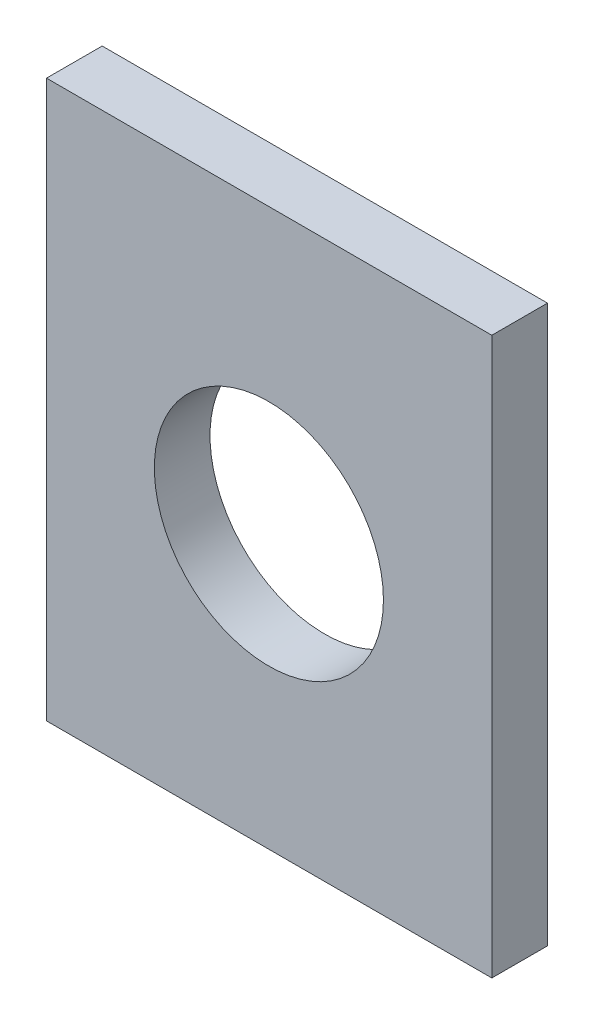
ISO-10303-21;
HEADER;
FILE_DESCRIPTION(('STEP AP214'),'2;1');
FILE_NAME('part.step','',(''),(''),'','','');
FILE_SCHEMA(('AUTOMOTIVE_DESIGN { 1 0 10303 214 1 1 1 1 }'));
ENDSEC;
DATA;
#1=APPLICATION_CONTEXT('core data for automotive mechanical design processes');
#2=APPLICATION_PROTOCOL_DEFINITION('international standard','automotive_design',2000,#1);
#3=PRODUCT_CONTEXT('',#1,'mechanical');
#4=PRODUCT('Part','Part','',(#3));
#5=PRODUCT_RELATED_PRODUCT_CATEGORY('part','',(#4));
#6=PRODUCT_DEFINITION_FORMATION('','',#4);
#7=PRODUCT_DEFINITION_CONTEXT('part definition',#1,'design');
#8=PRODUCT_DEFINITION('design','',#6,#7);
#9=PRODUCT_DEFINITION_SHAPE('','',#8);
#10=(LENGTH_UNIT() NAMED_UNIT(*) SI_UNIT(.MILLI.,.METRE.));
#11=(NAMED_UNIT(*) PLANE_ANGLE_UNIT() SI_UNIT($,.RADIAN.));
#12=(NAMED_UNIT(*) SI_UNIT($,.STERADIAN.) SOLID_ANGLE_UNIT());
#13=UNCERTAINTY_MEASURE_WITH_UNIT(LENGTH_MEASURE(1.E-05),#10,'distance_accuracy_value','');
#14=(GEOMETRIC_REPRESENTATION_CONTEXT(3) GLOBAL_UNCERTAINTY_ASSIGNED_CONTEXT((#13)) GLOBAL_UNIT_ASSIGNED_CONTEXT((#10,
#11,#12)) REPRESENTATION_CONTEXT('',''));
#15=CARTESIAN_POINT('',(0.,0.,0.));
#16=DIRECTION('',(0.,0.,1.));
#17=DIRECTION('',(1.,0.,0.));
#18=AXIS2_PLACEMENT_3D('',#15,#16,#17);
#19=CARTESIAN_POINT('',(0.,0.,10.));
#20=DIRECTION('',(1.,0.,0.));
#21=DIRECTION('',(0.,0.,-1.));
#22=AXIS2_PLACEMENT_3D('',#19,#20,#21);
#23=PLANE('',#22);
#24=DIRECTION('',(0.,-1.,0.));
#25=VECTOR('',#24,1.);
#26=CARTESIAN_POINT('',(0.,0.,0.));
#27=LINE('',#26,#25);
#28=CARTESIAN_POINT('',(0.,100.,0.));
#29=VERTEX_POINT('',#28);
#30=CARTESIAN_POINT('',(0.,0.,0.));
#31=VERTEX_POINT('',#30);
#32=EDGE_CURVE('E96',#29,#31,#27,.T.);
#33=ORIENTED_EDGE('',*,*,#32,.T.);
#34=DIRECTION('',(0.,0.,-1.));
#35=VECTOR('',#34,1.);
#36=CARTESIAN_POINT('',(0.,0.,10.));
#37=LINE('',#36,#35);
#38=CARTESIAN_POINT('',(0.,0.,10.));
#39=VERTEX_POINT('',#38);
#40=EDGE_CURVE('E11',#39,#31,#37,.T.);
#41=ORIENTED_EDGE('',*,*,#40,.F.);
#42=DIRECTION('',(0.,-1.,0.));
#43=VECTOR('',#42,1.);
#44=CARTESIAN_POINT('',(0.,0.,10.));
#45=LINE('',#44,#43);
#46=CARTESIAN_POINT('',(0.,100.,10.));
#47=VERTEX_POINT('',#46);
#48=EDGE_CURVE('E84',#47,#39,#45,.T.);
#49=ORIENTED_EDGE('',*,*,#48,.F.);
#50=DIRECTION('',(0.,0.,-1.));
#51=VECTOR('',#50,1.);
#52=CARTESIAN_POINT('',(0.,100.,10.));
#53=LINE('',#52,#51);
#54=EDGE_CURVE('E92',#47,#29,#53,.T.);
#55=ORIENTED_EDGE('',*,*,#54,.T.);
#56=EDGE_LOOP('',(#33,#41,#49,#55));
#57=FACE_BOUND('',#56,.T.);
#58=ADVANCED_FACE('F33',(#57),#23,.F.);
#59=CARTESIAN_POINT('',(0.,0.,10.));
#60=DIRECTION('',(0.,1.,0.));
#61=DIRECTION('',(0.,0.,1.));
#62=AXIS2_PLACEMENT_3D('',#59,#60,#61);
#63=PLANE('',#62);
#64=DIRECTION('',(1.,0.,0.));
#65=VECTOR('',#64,1.);
#66=CARTESIAN_POINT('',(0.,0.,0.));
#67=LINE('',#66,#65);
#68=CARTESIAN_POINT('',(80.,0.,0.));
#69=VERTEX_POINT('',#68);
#70=EDGE_CURVE('E88',#31,#69,#67,.T.);
#71=ORIENTED_EDGE('',*,*,#70,.T.);
#72=DIRECTION('',(0.,0.,-1.));
#73=VECTOR('',#72,1.);
#74=CARTESIAN_POINT('',(80.,0.,10.));
#75=LINE('',#74,#73);
#76=CARTESIAN_POINT('',(80.,0.,10.));
#77=VERTEX_POINT('',#76);
#78=EDGE_CURVE('E41',#77,#69,#75,.T.);
#79=ORIENTED_EDGE('',*,*,#78,.F.);
#80=DIRECTION('',(1.,0.,0.));
#81=VECTOR('',#80,1.);
#82=CARTESIAN_POINT('',(0.,0.,10.));
#83=LINE('',#82,#81);
#84=EDGE_CURVE('E79',#39,#77,#83,.T.);
#85=ORIENTED_EDGE('',*,*,#84,.F.);
#86=ORIENTED_EDGE('',*,*,#40,.T.);
#87=EDGE_LOOP('',(#71,#79,#85,#86));
#88=FACE_BOUND('',#87,.T.);
#89=ADVANCED_FACE('F87',(#88),#63,.F.);
#90=CARTESIAN_POINT('',(80.,0.,10.));
#91=DIRECTION('',(-1.,0.,0.));
#92=DIRECTION('',(0.,0.,1.));
#93=AXIS2_PLACEMENT_3D('',#90,#91,#92);
#94=PLANE('',#93);
#95=DIRECTION('',(0.,1.,0.));
#96=VECTOR('',#95,1.);
#97=CARTESIAN_POINT('',(80.,0.,0.));
#98=LINE('',#97,#96);
#99=CARTESIAN_POINT('',(80.,100.,0.));
#100=VERTEX_POINT('',#99);
#101=EDGE_CURVE('E66',#69,#100,#98,.T.);
#102=ORIENTED_EDGE('',*,*,#101,.T.);
#103=DIRECTION('',(0.,0.,-1.));
#104=VECTOR('',#103,1.);
#105=CARTESIAN_POINT('',(80.,100.,10.));
#106=LINE('',#105,#104);
#107=CARTESIAN_POINT('',(80.,100.,10.));
#108=VERTEX_POINT('',#107);
#109=EDGE_CURVE('E89',#108,#100,#106,.T.);
#110=ORIENTED_EDGE('',*,*,#109,.F.);
#111=DIRECTION('',(0.,1.,0.));
#112=VECTOR('',#111,1.);
#113=CARTESIAN_POINT('',(80.,0.,10.));
#114=LINE('',#113,#112);
#115=EDGE_CURVE('E82',#77,#108,#114,.T.);
#116=ORIENTED_EDGE('',*,*,#115,.F.);
#117=ORIENTED_EDGE('',*,*,#78,.T.);
#118=EDGE_LOOP('',(#102,#110,#116,#117));
#119=FACE_BOUND('',#118,.T.);
#120=ADVANCED_FACE('F90',(#119),#94,.F.);
#121=CARTESIAN_POINT('',(0.,100.,10.));
#122=DIRECTION('',(0.,-1.,0.));
#123=DIRECTION('',(0.,0.,-1.));
#124=AXIS2_PLACEMENT_3D('',#121,#122,#123);
#125=PLANE('',#124);
#126=DIRECTION('',(-1.,0.,0.));
#127=VECTOR('',#126,1.);
#128=CARTESIAN_POINT('',(0.,100.,0.));
#129=LINE('',#128,#127);
#130=EDGE_CURVE('E72',#100,#29,#129,.T.);
#131=ORIENTED_EDGE('',*,*,#130,.T.);
#132=ORIENTED_EDGE('',*,*,#54,.F.);
#133=DIRECTION('',(-1.,0.,0.));
#134=VECTOR('',#133,1.);
#135=CARTESIAN_POINT('',(0.,100.,10.));
#136=LINE('',#135,#134);
#137=EDGE_CURVE('E49',#108,#47,#136,.T.);
#138=ORIENTED_EDGE('',*,*,#137,.F.);
#139=ORIENTED_EDGE('',*,*,#109,.T.);
#140=EDGE_LOOP('',(#131,#132,#138,#139));
#141=FACE_BOUND('',#140,.T.);
#142=ADVANCED_FACE('F104',(#141),#125,.F.);
#143=CARTESIAN_POINT('',(0.,100.,10.));
#144=DIRECTION('',(0.,0.,-1.));
#145=DIRECTION('',(-1.,0.,0.));
#146=AXIS2_PLACEMENT_3D('',#143,#144,#145);
#147=PLANE('',#146);
#148=CARTESIAN_POINT('',(39.9492191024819,49.0670829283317,10.));
#149=DIRECTION('',(0.,0.,1.));
#150=DIRECTION('',(1.,0.,0.));
#151=AXIS2_PLACEMENT_3D('',#148,#149,#150);
#152=CIRCLE('',#151,20.5780023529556);
#153=CARTESIAN_POINT('',(60.5272214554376,49.0670829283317,10.));
#154=VERTEX_POINT('',#153);
#155=EDGE_CURVE('E110',#154,#154,#152,.T.);
#156=ORIENTED_EDGE('',*,*,#155,.F.);
#157=EDGE_LOOP('',(#156));
#158=FACE_BOUND('',#157,.T.);
#159=ORIENTED_EDGE('',*,*,#48,.T.);
#160=ORIENTED_EDGE('',*,*,#84,.T.);
#161=ORIENTED_EDGE('',*,*,#115,.T.);
#162=ORIENTED_EDGE('',*,*,#137,.T.);
#163=EDGE_LOOP('',(#159,#160,#161,#162));
#164=FACE_BOUND('',#163,.T.);
#165=ADVANCED_FACE('F80',(#158,#164),#147,.F.);
#166=CARTESIAN_POINT('',(0.,100.,0.));
#167=DIRECTION('',(0.,0.,-1.));
#168=DIRECTION('',(-1.,0.,0.));
#169=AXIS2_PLACEMENT_3D('',#166,#167,#168);
#170=PLANE('',#169);
#171=CARTESIAN_POINT('',(39.9492191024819,49.0670829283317,0.));
#172=DIRECTION('',(0.,0.,1.));
#173=DIRECTION('',(1.,0.,0.));
#174=AXIS2_PLACEMENT_3D('',#171,#172,#173);
#175=CIRCLE('',#174,20.5780023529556);
#176=CARTESIAN_POINT('',(60.5272214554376,49.0670829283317,0.));
#177=VERTEX_POINT('',#176);
#178=EDGE_CURVE('E99',#177,#177,#175,.T.);
#179=ORIENTED_EDGE('',*,*,#178,.T.);
#180=EDGE_LOOP('',(#179));
#181=FACE_BOUND('',#180,.T.);
#182=ORIENTED_EDGE('',*,*,#32,.F.);
#183=ORIENTED_EDGE('',*,*,#130,.F.);
#184=ORIENTED_EDGE('',*,*,#101,.F.);
#185=ORIENTED_EDGE('',*,*,#70,.F.);
#186=EDGE_LOOP('',(#182,#183,#184,#185));
#187=FACE_BOUND('',#186,.T.);
#188=ADVANCED_FACE('F107',(#181,#187),#170,.T.);
#189=CARTESIAN_POINT('',(39.9492191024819,49.0670829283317,0.));
#190=DIRECTION('',(0.,0.,1.));
#191=DIRECTION('',(1.,0.,0.));
#192=AXIS2_PLACEMENT_3D('',#189,#190,#191);
#193=CYLINDRICAL_SURFACE('',#192,20.5780023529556);
#194=ORIENTED_EDGE('',*,*,#178,.F.);
#195=EDGE_LOOP('',(#194));
#196=FACE_BOUND('',#195,.T.);
#197=ORIENTED_EDGE('',*,*,#155,.T.);
#198=EDGE_LOOP('',(#197));
#199=FACE_BOUND('',#198,.T.);
#200=ADVANCED_FACE('F117',(#196,#199),#193,.F.);
#201=CLOSED_SHELL('',(#58,#89,#120,#142,#165,#188,#200));
#202=MANIFOLD_SOLID_BREP('B2',#201);
#203=ADVANCED_BREP_SHAPE_REPRESENTATION('',(#18,#202),#14);
#204=SHAPE_DEFINITION_REPRESENTATION(#9,#203);
ENDSEC;
END-ISO-10303-21;
